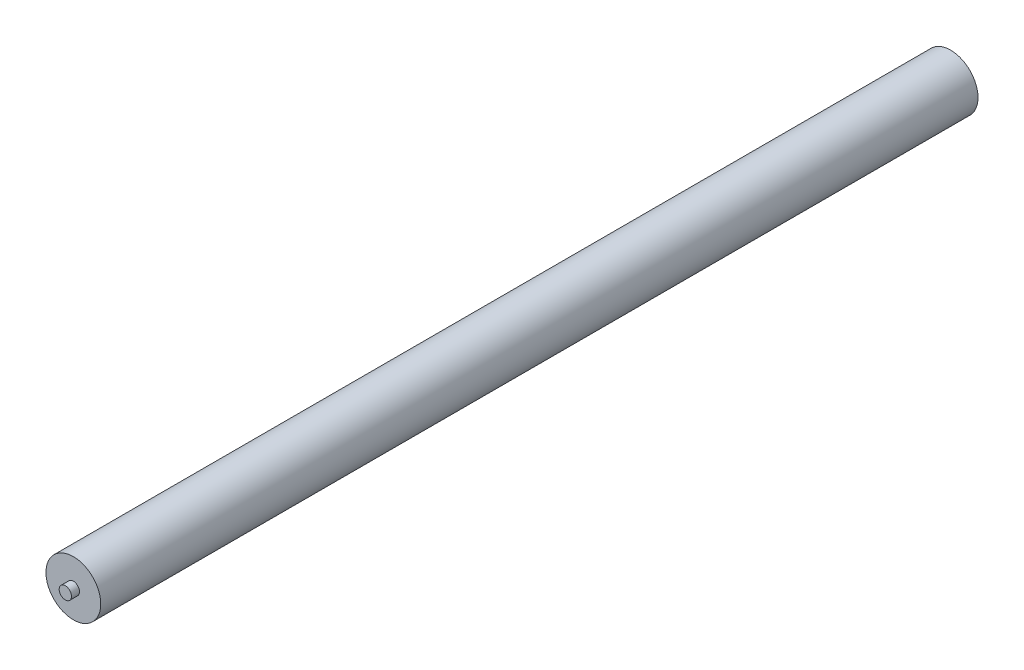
from build123d import *

# Parameters (mm, degrees)
ESQUISSE1_R          = 44.5
BASE_EXTRUSION_DEPTH = 1425
ESQUISSE2_R          = 10
BOSS_EXTRU_1_DEPTH   = 13
BOSS_EXTRU_2_START   = 13
ESQUISSE3_R          = 10
BOSS_EXTRU_2_DEPTH   = 13


with BuildPart() as part:
    # Esquisse1 → Base-Extrusion (new body)
    with BuildSketch(Plane.XY):
        Circle(ESQUISSE1_R)
    extrude(amount=BASE_EXTRUSION_DEPTH)

    # Esquisse2 → Boss.-Extru.1 (add)
    with BuildSketch(Plane.XY.offset(1425)):
        with Locations(Location((0, 0, 0), (0, 0, 180))):
            Circle(ESQUISSE2_R)
    extrude(amount=BOSS_EXTRU_1_DEPTH)

    # Esquisse3 → Boss.-Extru.2 (add)
    with BuildSketch(Plane(origin=(0, 0, 0), x_dir=(-1, 0, 0), z_dir=(0, 0, -1)).offset(BOSS_EXTRU_2_START)):
        Circle(ESQUISSE3_R)
    extrude(amount=-BOSS_EXTRU_2_DEPTH)


solid = part.part
